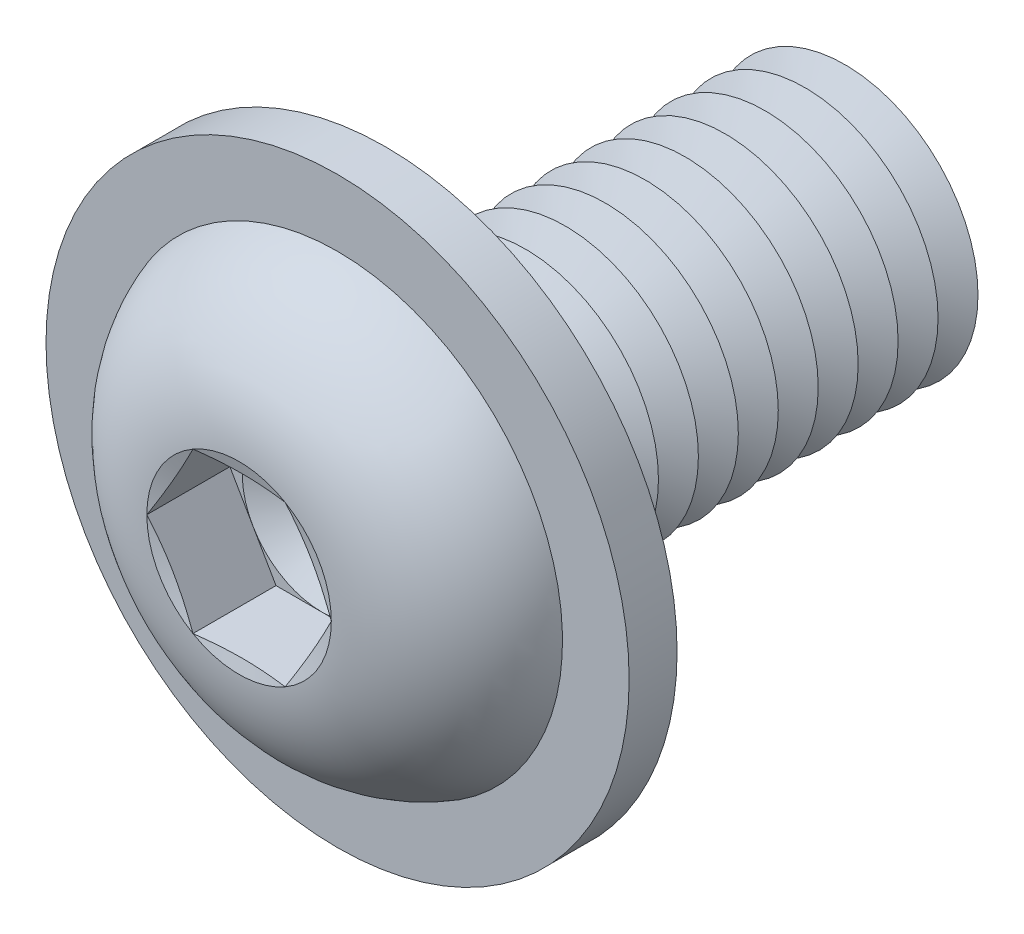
ISO-10303-21;
HEADER;
FILE_DESCRIPTION(('STEP AP214'),'2;1');
FILE_NAME('part.step','',(''),(''),'','','');
FILE_SCHEMA(('AUTOMOTIVE_DESIGN { 1 0 10303 214 1 1 1 1 }'));
ENDSEC;
DATA;
#1=APPLICATION_CONTEXT('core data for automotive mechanical design processes');
#2=APPLICATION_PROTOCOL_DEFINITION('international standard','automotive_design',2000,#1);
#3=PRODUCT_CONTEXT('',#1,'mechanical');
#4=PRODUCT('Part','Part','',(#3));
#5=PRODUCT_RELATED_PRODUCT_CATEGORY('part','',(#4));
#6=PRODUCT_DEFINITION_FORMATION('','',#4);
#7=PRODUCT_DEFINITION_CONTEXT('part definition',#1,'design');
#8=PRODUCT_DEFINITION('design','',#6,#7);
#9=PRODUCT_DEFINITION_SHAPE('','',#8);
#10=(LENGTH_UNIT() NAMED_UNIT(*) SI_UNIT(.MILLI.,.METRE.));
#11=(NAMED_UNIT(*) PLANE_ANGLE_UNIT() SI_UNIT($,.RADIAN.));
#12=(NAMED_UNIT(*) SI_UNIT($,.STERADIAN.) SOLID_ANGLE_UNIT());
#13=UNCERTAINTY_MEASURE_WITH_UNIT(LENGTH_MEASURE(1.E-05),#10,'distance_accuracy_value','');
#14=(GEOMETRIC_REPRESENTATION_CONTEXT(3) GLOBAL_UNCERTAINTY_ASSIGNED_CONTEXT((#13)) GLOBAL_UNIT_ASSIGNED_CONTEXT((#10,
#11,#12)) REPRESENTATION_CONTEXT('',''));
#15=CARTESIAN_POINT('',(0.,0.,0.));
#16=DIRECTION('',(0.,0.,1.));
#17=DIRECTION('',(1.,0.,0.));
#18=AXIS2_PLACEMENT_3D('',#15,#16,#17);
#19=CARTESIAN_POINT('',(0.,0.,-12.75));
#20=DIRECTION('',(0.,0.,1.));
#21=DIRECTION('',(1.,0.,0.));
#22=AXIS2_PLACEMENT_3D('',#19,#20,#21);
#23=CONICAL_SURFACE('',#22,5.,1.0471975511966);
#24=CARTESIAN_POINT('',(0.,0.,-13.5));
#25=DIRECTION('',(0.,0.,1.));
#26=DIRECTION('',(1.,0.,0.));
#27=AXIS2_PLACEMENT_3D('',#24,#25,#26);
#28=CIRCLE('',#27,3.70096189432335);
#29=CARTESIAN_POINT('',(3.70096189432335,0.,-13.5));
#30=VERTEX_POINT('',#29);
#31=EDGE_CURVE('E351',#30,#30,#28,.T.);
#32=ORIENTED_EDGE('',*,*,#31,.T.);
#33=EDGE_LOOP('',(#32));
#34=FACE_BOUND('',#33,.T.);
#35=CARTESIAN_POINT('',(0.,0.,-12.75));
#36=DIRECTION('',(0.,0.,1.));
#37=DIRECTION('',(1.,0.,0.));
#38=AXIS2_PLACEMENT_3D('',#35,#36,#37);
#39=CIRCLE('',#38,5.);
#40=CARTESIAN_POINT('',(5.,0.,-12.75));
#41=VERTEX_POINT('',#40);
#42=EDGE_CURVE('E349',#41,#41,#39,.T.);
#43=ORIENTED_EDGE('',*,*,#42,.F.);
#44=EDGE_LOOP('',(#43));
#45=FACE_BOUND('',#44,.T.);
#46=ADVANCED_FACE('F39',(#34,#45),#23,.T.);
#47=CARTESIAN_POINT('',(0.,0.,-13.5));
#48=DIRECTION('',(0.,0.,-1.));
#49=DIRECTION('',(-1.,0.,0.));
#50=AXIS2_PLACEMENT_3D('',#47,#48,#49);
#51=CONICAL_SURFACE('',#50,3.70096189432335,1.0471975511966);
#52=CARTESIAN_POINT('',(0.,0.,-14.25));
#53=DIRECTION('',(0.,0.,1.));
#54=DIRECTION('',(1.,0.,0.));
#55=AXIS2_PLACEMENT_3D('',#52,#53,#54);
#56=CIRCLE('',#55,5.);
#57=CARTESIAN_POINT('',(5.,0.,-14.25));
#58=VERTEX_POINT('',#57);
#59=EDGE_CURVE('E326',#58,#58,#56,.T.);
#60=ORIENTED_EDGE('',*,*,#59,.T.);
#61=EDGE_LOOP('',(#60));
#62=FACE_BOUND('',#61,.T.);
#63=ORIENTED_EDGE('',*,*,#31,.F.);
#64=EDGE_LOOP('',(#63));
#65=FACE_BOUND('',#64,.T.);
#66=ADVANCED_FACE('F401',(#62,#65),#51,.T.);
#67=CARTESIAN_POINT('',(0.,5.00000000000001,-18.));
#68=DIRECTION('',(0.,0.,-1.));
#69=DIRECTION('',(-1.,0.,0.));
#70=AXIS2_PLACEMENT_3D('',#67,#68,#69);
#71=PLANE('',#70);
#72=CARTESIAN_POINT('',(0.,0.,-18.));
#73=DIRECTION('',(0.,0.,1.));
#74=DIRECTION('',(1.,0.,0.));
#75=AXIS2_PLACEMENT_3D('',#72,#73,#74);
#76=CIRCLE('',#75,3.70096189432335);
#77=CARTESIAN_POINT('',(3.70096189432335,0.,-18.));
#78=VERTEX_POINT('',#77);
#79=EDGE_CURVE('E319',#78,#78,#76,.T.);
#80=ORIENTED_EDGE('',*,*,#79,.F.);
#81=EDGE_LOOP('',(#80));
#82=FACE_BOUND('',#81,.T.);
#83=ADVANCED_FACE('F407',(#82),#71,.T.);
#84=CARTESIAN_POINT('',(0.,0.,-17.25));
#85=DIRECTION('',(0.,0.,1.));
#86=DIRECTION('',(1.,0.,0.));
#87=AXIS2_PLACEMENT_3D('',#84,#85,#86);
#88=CONICAL_SURFACE('',#87,5.,1.0471975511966);
#89=ORIENTED_EDGE('',*,*,#79,.T.);
#90=EDGE_LOOP('',(#89));
#91=FACE_BOUND('',#90,.T.);
#92=CARTESIAN_POINT('',(0.,0.,-17.25));
#93=DIRECTION('',(0.,0.,1.));
#94=DIRECTION('',(1.,0.,0.));
#95=AXIS2_PLACEMENT_3D('',#92,#93,#94);
#96=CIRCLE('',#95,5.);
#97=CARTESIAN_POINT('',(5.,0.,-17.25));
#98=VERTEX_POINT('',#97);
#99=EDGE_CURVE('E441',#98,#98,#96,.T.);
#100=ORIENTED_EDGE('',*,*,#99,.F.);
#101=EDGE_LOOP('',(#100));
#102=FACE_BOUND('',#101,.T.);
#103=ADVANCED_FACE('F427',(#91,#102),#88,.T.);
#104=CARTESIAN_POINT('',(0.,0.,-16.5));
#105=DIRECTION('',(0.,0.,-1.));
#106=DIRECTION('',(-1.,0.,0.));
#107=AXIS2_PLACEMENT_3D('',#104,#105,#106);
#108=CONICAL_SURFACE('',#107,3.70096189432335,1.0471975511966);
#109=ORIENTED_EDGE('',*,*,#99,.T.);
#110=EDGE_LOOP('',(#109));
#111=FACE_BOUND('',#110,.T.);
#112=CARTESIAN_POINT('',(0.,0.,-16.5));
#113=DIRECTION('',(0.,0.,1.));
#114=DIRECTION('',(1.,0.,0.));
#115=AXIS2_PLACEMENT_3D('',#112,#113,#114);
#116=CIRCLE('',#115,3.70096189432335);
#117=CARTESIAN_POINT('',(3.70096189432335,0.,-16.5));
#118=VERTEX_POINT('',#117);
#119=EDGE_CURVE('E445',#118,#118,#116,.T.);
#120=ORIENTED_EDGE('',*,*,#119,.F.);
#121=EDGE_LOOP('',(#120));
#122=FACE_BOUND('',#121,.T.);
#123=ADVANCED_FACE('F424',(#111,#122),#108,.T.);
#124=CARTESIAN_POINT('',(0.,0.,-15.75));
#125=DIRECTION('',(0.,0.,1.));
#126=DIRECTION('',(1.,0.,0.));
#127=AXIS2_PLACEMENT_3D('',#124,#125,#126);
#128=CONICAL_SURFACE('',#127,5.,1.0471975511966);
#129=ORIENTED_EDGE('',*,*,#119,.T.);
#130=EDGE_LOOP('',(#129));
#131=FACE_BOUND('',#130,.T.);
#132=CARTESIAN_POINT('',(0.,0.,-15.75));
#133=DIRECTION('',(0.,0.,1.));
#134=DIRECTION('',(1.,0.,0.));
#135=AXIS2_PLACEMENT_3D('',#132,#133,#134);
#136=CIRCLE('',#135,5.);
#137=CARTESIAN_POINT('',(5.,0.,-15.75));
#138=VERTEX_POINT('',#137);
#139=EDGE_CURVE('E325',#138,#138,#136,.T.);
#140=ORIENTED_EDGE('',*,*,#139,.F.);
#141=EDGE_LOOP('',(#140));
#142=FACE_BOUND('',#141,.T.);
#143=ADVANCED_FACE('F418',(#131,#142),#128,.T.);
#144=CARTESIAN_POINT('',(0.,0.,-15.));
#145=DIRECTION('',(0.,0.,-1.));
#146=DIRECTION('',(-1.,0.,0.));
#147=AXIS2_PLACEMENT_3D('',#144,#145,#146);
#148=CONICAL_SURFACE('',#147,3.70096189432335,1.0471975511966);
#149=ORIENTED_EDGE('',*,*,#139,.T.);
#150=EDGE_LOOP('',(#149));
#151=FACE_BOUND('',#150,.T.);
#152=CARTESIAN_POINT('',(0.,0.,-15.));
#153=DIRECTION('',(0.,0.,1.));
#154=DIRECTION('',(1.,0.,0.));
#155=AXIS2_PLACEMENT_3D('',#152,#153,#154);
#156=CIRCLE('',#155,3.70096189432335);
#157=CARTESIAN_POINT('',(3.70096189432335,0.,-15.));
#158=VERTEX_POINT('',#157);
#159=EDGE_CURVE('E322',#158,#158,#156,.T.);
#160=ORIENTED_EDGE('',*,*,#159,.F.);
#161=EDGE_LOOP('',(#160));
#162=FACE_BOUND('',#161,.T.);
#163=ADVANCED_FACE('F414',(#151,#162),#148,.T.);
#164=CARTESIAN_POINT('',(0.,0.,-14.25));
#165=DIRECTION('',(0.,0.,1.));
#166=DIRECTION('',(1.,0.,0.));
#167=AXIS2_PLACEMENT_3D('',#164,#165,#166);
#168=CONICAL_SURFACE('',#167,5.,1.0471975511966);
#169=ORIENTED_EDGE('',*,*,#159,.T.);
#170=EDGE_LOOP('',(#169));
#171=FACE_BOUND('',#170,.T.);
#172=ORIENTED_EDGE('',*,*,#59,.F.);
#173=EDGE_LOOP('',(#172));
#174=FACE_BOUND('',#173,.T.);
#175=ADVANCED_FACE('F417',(#171,#174),#168,.T.);
#176=CARTESIAN_POINT('',(0.,0.,-11.25));
#177=DIRECTION('',(0.,0.,1.));
#178=DIRECTION('',(1.,0.,0.));
#179=AXIS2_PLACEMENT_3D('',#176,#177,#178);
#180=CONICAL_SURFACE('',#179,5.,1.0471975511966);
#181=CARTESIAN_POINT('',(0.,0.,-12.));
#182=DIRECTION('',(0.,0.,1.));
#183=DIRECTION('',(1.,0.,0.));
#184=AXIS2_PLACEMENT_3D('',#181,#182,#183);
#185=CIRCLE('',#184,3.70096189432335);
#186=CARTESIAN_POINT('',(3.70096189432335,0.,-12.));
#187=VERTEX_POINT('',#186);
#188=EDGE_CURVE('E352',#187,#187,#185,.T.);
#189=ORIENTED_EDGE('',*,*,#188,.T.);
#190=EDGE_LOOP('',(#189));
#191=FACE_BOUND('',#190,.T.);
#192=CARTESIAN_POINT('',(0.,0.,-11.25));
#193=DIRECTION('',(0.,0.,1.));
#194=DIRECTION('',(1.,0.,0.));
#195=AXIS2_PLACEMENT_3D('',#192,#193,#194);
#196=CIRCLE('',#195,5.);
#197=CARTESIAN_POINT('',(5.,0.,-11.25));
#198=VERTEX_POINT('',#197);
#199=EDGE_CURVE('E462',#198,#198,#196,.T.);
#200=ORIENTED_EDGE('',*,*,#199,.F.);
#201=EDGE_LOOP('',(#200));
#202=FACE_BOUND('',#201,.T.);
#203=ADVANCED_FACE('F422',(#191,#202),#180,.T.);
#204=CARTESIAN_POINT('',(0.,0.,-12.));
#205=DIRECTION('',(0.,0.,-1.));
#206=DIRECTION('',(-1.,0.,0.));
#207=AXIS2_PLACEMENT_3D('',#204,#205,#206);
#208=CONICAL_SURFACE('',#207,3.70096189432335,1.0471975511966);
#209=ORIENTED_EDGE('',*,*,#42,.T.);
#210=EDGE_LOOP('',(#209));
#211=FACE_BOUND('',#210,.T.);
#212=ORIENTED_EDGE('',*,*,#188,.F.);
#213=EDGE_LOOP('',(#212));
#214=FACE_BOUND('',#213,.T.);
#215=ADVANCED_FACE('F565',(#211,#214),#208,.T.);
#216=CARTESIAN_POINT('',(0.,0.,-9.75));
#217=DIRECTION('',(0.,0.,1.));
#218=DIRECTION('',(1.,0.,0.));
#219=AXIS2_PLACEMENT_3D('',#216,#217,#218);
#220=CONICAL_SURFACE('',#219,5.,1.0471975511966);
#221=CARTESIAN_POINT('',(0.,0.,-10.5));
#222=DIRECTION('',(0.,0.,1.));
#223=DIRECTION('',(1.,0.,0.));
#224=AXIS2_PLACEMENT_3D('',#221,#222,#223);
#225=CIRCLE('',#224,3.70096189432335);
#226=CARTESIAN_POINT('',(3.70096189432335,0.,-10.5));
#227=VERTEX_POINT('',#226);
#228=EDGE_CURVE('E466',#227,#227,#225,.T.);
#229=ORIENTED_EDGE('',*,*,#228,.T.);
#230=EDGE_LOOP('',(#229));
#231=FACE_BOUND('',#230,.T.);
#232=CARTESIAN_POINT('',(0.,0.,-9.75));
#233=DIRECTION('',(0.,0.,1.));
#234=DIRECTION('',(1.,0.,0.));
#235=AXIS2_PLACEMENT_3D('',#232,#233,#234);
#236=CIRCLE('',#235,5.);
#237=CARTESIAN_POINT('',(5.,0.,-9.75));
#238=VERTEX_POINT('',#237);
#239=EDGE_CURVE('E330',#238,#238,#236,.T.);
#240=ORIENTED_EDGE('',*,*,#239,.F.);
#241=EDGE_LOOP('',(#240));
#242=FACE_BOUND('',#241,.T.);
#243=ADVANCED_FACE('F561',(#231,#242),#220,.T.);
#244=CARTESIAN_POINT('',(0.,0.,-10.5));
#245=DIRECTION('',(0.,0.,-1.));
#246=DIRECTION('',(-1.,0.,0.));
#247=AXIS2_PLACEMENT_3D('',#244,#245,#246);
#248=CONICAL_SURFACE('',#247,3.70096189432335,1.0471975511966);
#249=ORIENTED_EDGE('',*,*,#199,.T.);
#250=EDGE_LOOP('',(#249));
#251=FACE_BOUND('',#250,.T.);
#252=ORIENTED_EDGE('',*,*,#228,.F.);
#253=EDGE_LOOP('',(#252));
#254=FACE_BOUND('',#253,.T.);
#255=ADVANCED_FACE('F557',(#251,#254),#248,.T.);
#256=CARTESIAN_POINT('',(0.,0.,-8.25));
#257=DIRECTION('',(0.,0.,1.));
#258=DIRECTION('',(1.,0.,0.));
#259=AXIS2_PLACEMENT_3D('',#256,#257,#258);
#260=CONICAL_SURFACE('',#259,5.,1.0471975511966);
#261=CARTESIAN_POINT('',(0.,0.,-9.));
#262=DIRECTION('',(0.,0.,1.));
#263=DIRECTION('',(1.,0.,0.));
#264=AXIS2_PLACEMENT_3D('',#261,#262,#263);
#265=CIRCLE('',#264,3.70096189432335);
#266=CARTESIAN_POINT('',(3.70096189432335,0.,-9.));
#267=VERTEX_POINT('',#266);
#268=EDGE_CURVE('E328',#267,#267,#265,.T.);
#269=ORIENTED_EDGE('',*,*,#268,.T.);
#270=EDGE_LOOP('',(#269));
#271=FACE_BOUND('',#270,.T.);
#272=CARTESIAN_POINT('',(0.,0.,-8.25));
#273=DIRECTION('',(0.,0.,1.));
#274=DIRECTION('',(1.,0.,0.));
#275=AXIS2_PLACEMENT_3D('',#272,#273,#274);
#276=CIRCLE('',#275,5.);
#277=CARTESIAN_POINT('',(5.,0.,-8.25));
#278=VERTEX_POINT('',#277);
#279=EDGE_CURVE('E331',#278,#278,#276,.T.);
#280=ORIENTED_EDGE('',*,*,#279,.F.);
#281=EDGE_LOOP('',(#280));
#282=FACE_BOUND('',#281,.T.);
#283=ADVANCED_FACE('F553',(#271,#282),#260,.T.);
#284=CARTESIAN_POINT('',(0.,0.,-9.));
#285=DIRECTION('',(0.,0.,-1.));
#286=DIRECTION('',(-1.,0.,0.));
#287=AXIS2_PLACEMENT_3D('',#284,#285,#286);
#288=CONICAL_SURFACE('',#287,3.70096189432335,1.0471975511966);
#289=ORIENTED_EDGE('',*,*,#239,.T.);
#290=EDGE_LOOP('',(#289));
#291=FACE_BOUND('',#290,.T.);
#292=ORIENTED_EDGE('',*,*,#268,.F.);
#293=EDGE_LOOP('',(#292));
#294=FACE_BOUND('',#293,.T.);
#295=ADVANCED_FACE('F549',(#291,#294),#288,.T.);
#296=CARTESIAN_POINT('',(0.,0.,-6.75));
#297=DIRECTION('',(0.,0.,1.));
#298=DIRECTION('',(1.,0.,0.));
#299=AXIS2_PLACEMENT_3D('',#296,#297,#298);
#300=CONICAL_SURFACE('',#299,5.,1.0471975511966);
#301=CARTESIAN_POINT('',(0.,0.,-7.5));
#302=DIRECTION('',(0.,0.,1.));
#303=DIRECTION('',(1.,0.,0.));
#304=AXIS2_PLACEMENT_3D('',#301,#302,#303);
#305=CIRCLE('',#304,3.70096189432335);
#306=CARTESIAN_POINT('',(3.70096189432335,0.,-7.5));
#307=VERTEX_POINT('',#306);
#308=EDGE_CURVE('E337',#307,#307,#305,.T.);
#309=ORIENTED_EDGE('',*,*,#308,.T.);
#310=EDGE_LOOP('',(#309));
#311=FACE_BOUND('',#310,.T.);
#312=CARTESIAN_POINT('',(0.,0.,-6.75));
#313=DIRECTION('',(0.,0.,1.));
#314=DIRECTION('',(1.,0.,0.));
#315=AXIS2_PLACEMENT_3D('',#312,#313,#314);
#316=CIRCLE('',#315,5.);
#317=CARTESIAN_POINT('',(5.,0.,-6.75));
#318=VERTEX_POINT('',#317);
#319=EDGE_CURVE('E334',#318,#318,#316,.T.);
#320=ORIENTED_EDGE('',*,*,#319,.F.);
#321=EDGE_LOOP('',(#320));
#322=FACE_BOUND('',#321,.T.);
#323=ADVANCED_FACE('F545',(#311,#322),#300,.T.);
#324=CARTESIAN_POINT('',(0.,0.,-7.5));
#325=DIRECTION('',(0.,0.,-1.));
#326=DIRECTION('',(-1.,0.,0.));
#327=AXIS2_PLACEMENT_3D('',#324,#325,#326);
#328=CONICAL_SURFACE('',#327,3.70096189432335,1.0471975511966);
#329=ORIENTED_EDGE('',*,*,#279,.T.);
#330=EDGE_LOOP('',(#329));
#331=FACE_BOUND('',#330,.T.);
#332=ORIENTED_EDGE('',*,*,#308,.F.);
#333=EDGE_LOOP('',(#332));
#334=FACE_BOUND('',#333,.T.);
#335=ADVANCED_FACE('F541',(#331,#334),#328,.T.);
#336=CARTESIAN_POINT('',(0.,0.,-5.25));
#337=DIRECTION('',(0.,0.,1.));
#338=DIRECTION('',(1.,0.,0.));
#339=AXIS2_PLACEMENT_3D('',#336,#337,#338);
#340=CONICAL_SURFACE('',#339,5.,1.0471975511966);
#341=CARTESIAN_POINT('',(0.,0.,-6.));
#342=DIRECTION('',(0.,0.,1.));
#343=DIRECTION('',(1.,0.,0.));
#344=AXIS2_PLACEMENT_3D('',#341,#342,#343);
#345=CIRCLE('',#344,3.70096189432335);
#346=CARTESIAN_POINT('',(3.70096189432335,0.,-6.));
#347=VERTEX_POINT('',#346);
#348=EDGE_CURVE('E338',#347,#347,#345,.T.);
#349=ORIENTED_EDGE('',*,*,#348,.T.);
#350=EDGE_LOOP('',(#349));
#351=FACE_BOUND('',#350,.T.);
#352=CARTESIAN_POINT('',(0.,0.,-5.25));
#353=DIRECTION('',(0.,0.,1.));
#354=DIRECTION('',(1.,0.,0.));
#355=AXIS2_PLACEMENT_3D('',#352,#353,#354);
#356=CIRCLE('',#355,5.);
#357=CARTESIAN_POINT('',(5.,0.,-5.25));
#358=VERTEX_POINT('',#357);
#359=EDGE_CURVE('E479',#358,#358,#356,.T.);
#360=ORIENTED_EDGE('',*,*,#359,.F.);
#361=EDGE_LOOP('',(#360));
#362=FACE_BOUND('',#361,.T.);
#363=ADVANCED_FACE('F537',(#351,#362),#340,.T.);
#364=CARTESIAN_POINT('',(0.,0.,-6.));
#365=DIRECTION('',(0.,0.,-1.));
#366=DIRECTION('',(-1.,0.,0.));
#367=AXIS2_PLACEMENT_3D('',#364,#365,#366);
#368=CONICAL_SURFACE('',#367,3.70096189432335,1.0471975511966);
#369=ORIENTED_EDGE('',*,*,#319,.T.);
#370=EDGE_LOOP('',(#369));
#371=FACE_BOUND('',#370,.T.);
#372=ORIENTED_EDGE('',*,*,#348,.F.);
#373=EDGE_LOOP('',(#372));
#374=FACE_BOUND('',#373,.T.);
#375=ADVANCED_FACE('F533',(#371,#374),#368,.T.);
#376=CARTESIAN_POINT('',(0.,0.,-3.75));
#377=DIRECTION('',(0.,0.,1.));
#378=DIRECTION('',(1.,0.,0.));
#379=AXIS2_PLACEMENT_3D('',#376,#377,#378);
#380=CONICAL_SURFACE('',#379,5.,1.0471975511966);
#381=CARTESIAN_POINT('',(0.,0.,-4.5));
#382=DIRECTION('',(0.,0.,1.));
#383=DIRECTION('',(1.,0.,0.));
#384=AXIS2_PLACEMENT_3D('',#381,#382,#383);
#385=CIRCLE('',#384,3.70096189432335);
#386=CARTESIAN_POINT('',(3.70096189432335,0.,-4.5));
#387=VERTEX_POINT('',#386);
#388=EDGE_CURVE('E483',#387,#387,#385,.T.);
#389=ORIENTED_EDGE('',*,*,#388,.T.);
#390=EDGE_LOOP('',(#389));
#391=FACE_BOUND('',#390,.T.);
#392=CARTESIAN_POINT('',(0.,0.,-3.75));
#393=DIRECTION('',(0.,0.,1.));
#394=DIRECTION('',(1.,0.,0.));
#395=AXIS2_PLACEMENT_3D('',#392,#393,#394);
#396=CIRCLE('',#395,5.);
#397=CARTESIAN_POINT('',(5.,0.,-3.75));
#398=VERTEX_POINT('',#397);
#399=EDGE_CURVE('E487',#398,#398,#396,.T.);
#400=ORIENTED_EDGE('',*,*,#399,.F.);
#401=EDGE_LOOP('',(#400));
#402=FACE_BOUND('',#401,.T.);
#403=ADVANCED_FACE('F529',(#391,#402),#380,.T.);
#404=CARTESIAN_POINT('',(0.,0.,-4.5));
#405=DIRECTION('',(0.,0.,-1.));
#406=DIRECTION('',(-1.,0.,0.));
#407=AXIS2_PLACEMENT_3D('',#404,#405,#406);
#408=CONICAL_SURFACE('',#407,3.70096189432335,1.0471975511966);
#409=ORIENTED_EDGE('',*,*,#359,.T.);
#410=EDGE_LOOP('',(#409));
#411=FACE_BOUND('',#410,.T.);
#412=ORIENTED_EDGE('',*,*,#388,.F.);
#413=EDGE_LOOP('',(#412));
#414=FACE_BOUND('',#413,.T.);
#415=ADVANCED_FACE('F525',(#411,#414),#408,.T.);
#416=CARTESIAN_POINT('',(0.,0.,-2.25));
#417=DIRECTION('',(0.,0.,1.));
#418=DIRECTION('',(1.,0.,0.));
#419=AXIS2_PLACEMENT_3D('',#416,#417,#418);
#420=CONICAL_SURFACE('',#419,5.,1.0471975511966);
#421=CARTESIAN_POINT('',(0.,0.,-3.));
#422=DIRECTION('',(0.,0.,1.));
#423=DIRECTION('',(1.,0.,0.));
#424=AXIS2_PLACEMENT_3D('',#421,#422,#423);
#425=CIRCLE('',#424,3.70096189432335);
#426=CARTESIAN_POINT('',(3.70096189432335,0.,-3.));
#427=VERTEX_POINT('',#426);
#428=EDGE_CURVE('E490',#427,#427,#425,.T.);
#429=ORIENTED_EDGE('',*,*,#428,.T.);
#430=EDGE_LOOP('',(#429));
#431=FACE_BOUND('',#430,.T.);
#432=CARTESIAN_POINT('',(0.,0.,-2.25));
#433=DIRECTION('',(0.,0.,1.));
#434=DIRECTION('',(1.,0.,0.));
#435=AXIS2_PLACEMENT_3D('',#432,#433,#434);
#436=CIRCLE('',#435,5.);
#437=CARTESIAN_POINT('',(5.,0.,-2.25));
#438=VERTEX_POINT('',#437);
#439=EDGE_CURVE('E497',#438,#438,#436,.T.);
#440=ORIENTED_EDGE('',*,*,#439,.F.);
#441=EDGE_LOOP('',(#440));
#442=FACE_BOUND('',#441,.T.);
#443=ADVANCED_FACE('F519',(#431,#442),#420,.T.);
#444=CARTESIAN_POINT('',(0.,0.,-3.));
#445=DIRECTION('',(0.,0.,-1.));
#446=DIRECTION('',(-1.,0.,0.));
#447=AXIS2_PLACEMENT_3D('',#444,#445,#446);
#448=CONICAL_SURFACE('',#447,3.70096189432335,1.0471975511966);
#449=ORIENTED_EDGE('',*,*,#399,.T.);
#450=EDGE_LOOP('',(#449));
#451=FACE_BOUND('',#450,.T.);
#452=ORIENTED_EDGE('',*,*,#428,.F.);
#453=EDGE_LOOP('',(#452));
#454=FACE_BOUND('',#453,.T.);
#455=ADVANCED_FACE('F515',(#451,#454),#448,.T.);
#456=CARTESIAN_POINT('',(0.,0.,-0.750000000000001));
#457=DIRECTION('',(0.,0.,1.));
#458=DIRECTION('',(1.,0.,0.));
#459=AXIS2_PLACEMENT_3D('',#456,#457,#458);
#460=CONICAL_SURFACE('',#459,5.,1.0471975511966);
#461=CARTESIAN_POINT('',(0.,0.,-1.5));
#462=DIRECTION('',(0.,0.,1.));
#463=DIRECTION('',(1.,0.,0.));
#464=AXIS2_PLACEMENT_3D('',#461,#462,#463);
#465=CIRCLE('',#464,3.70096189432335);
#466=CARTESIAN_POINT('',(3.70096189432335,0.,-1.5));
#467=VERTEX_POINT('',#466);
#468=EDGE_CURVE('E227',#467,#467,#465,.T.);
#469=ORIENTED_EDGE('',*,*,#468,.T.);
#470=EDGE_LOOP('',(#469));
#471=FACE_BOUND('',#470,.T.);
#472=CARTESIAN_POINT('',(0.,0.,-0.750000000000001));
#473=DIRECTION('',(0.,0.,1.));
#474=DIRECTION('',(1.,0.,0.));
#475=AXIS2_PLACEMENT_3D('',#472,#473,#474);
#476=CIRCLE('',#475,5.);
#477=CARTESIAN_POINT('',(5.,0.,-0.750000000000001));
#478=VERTEX_POINT('',#477);
#479=EDGE_CURVE('E494',#478,#478,#476,.T.);
#480=ORIENTED_EDGE('',*,*,#479,.F.);
#481=EDGE_LOOP('',(#480));
#482=FACE_BOUND('',#481,.T.);
#483=ADVANCED_FACE('F506',(#471,#482),#460,.T.);
#484=CARTESIAN_POINT('',(0.,0.,-1.5));
#485=DIRECTION('',(0.,0.,-1.));
#486=DIRECTION('',(-1.,0.,0.));
#487=AXIS2_PLACEMENT_3D('',#484,#485,#486);
#488=CONICAL_SURFACE('',#487,3.70096189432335,1.0471975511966);
#489=ORIENTED_EDGE('',*,*,#439,.T.);
#490=EDGE_LOOP('',(#489));
#491=FACE_BOUND('',#490,.T.);
#492=ORIENTED_EDGE('',*,*,#468,.F.);
#493=EDGE_LOOP('',(#492));
#494=FACE_BOUND('',#493,.T.);
#495=ADVANCED_FACE('F211',(#491,#494),#488,.T.);
#496=CARTESIAN_POINT('',(0.,5.,0.));
#497=DIRECTION('',(0.,0.,-1.));
#498=DIRECTION('',(-1.,0.,0.));
#499=AXIS2_PLACEMENT_3D('',#496,#497,#498);
#500=PLANE('',#499);
#501=CARTESIAN_POINT('',(0.,0.,0.));
#502=DIRECTION('',(0.,0.,-1.));
#503=DIRECTION('',(-1.,0.,0.));
#504=AXIS2_PLACEMENT_3D('',#501,#502,#503);
#505=CIRCLE('',#504,5.75);
#506=CARTESIAN_POINT('',(-5.75,0.,0.));
#507=VERTEX_POINT('',#506);
#508=EDGE_CURVE('E282',#507,#507,#505,.F.);
#509=ORIENTED_EDGE('',*,*,#508,.T.);
#510=EDGE_LOOP('',(#509));
#511=FACE_BOUND('',#510,.T.);
#512=CARTESIAN_POINT('',(0.,0.,0.));
#513=DIRECTION('',(0.,0.,-1.));
#514=DIRECTION('',(0.,1.,0.));
#515=AXIS2_PLACEMENT_3D('',#512,#513,#514);
#516=CIRCLE('',#515,10.95);
#517=CARTESIAN_POINT('',(0.,10.95,0.));
#518=VERTEX_POINT('',#517);
#519=EDGE_CURVE('E959',#518,#518,#516,.T.);
#520=ORIENTED_EDGE('',*,*,#519,.T.);
#521=EDGE_LOOP('',(#520));
#522=FACE_BOUND('',#521,.T.);
#523=ADVANCED_FACE('F510',(#511,#522),#500,.T.);
#524=CARTESIAN_POINT('',(0.,0.,-0.750000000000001));
#525=DIRECTION('',(0.,0.,-1.));
#526=DIRECTION('',(-1.,0.,0.));
#527=AXIS2_PLACEMENT_3D('',#524,#525,#526);
#528=TOROIDAL_SURFACE('',#527,5.75,0.75);
#529=ORIENTED_EDGE('',*,*,#508,.F.);
#530=EDGE_LOOP('',(#529));
#531=FACE_BOUND('',#530,.T.);
#532=ORIENTED_EDGE('',*,*,#479,.T.);
#533=EDGE_LOOP('',(#532));
#534=FACE_BOUND('',#533,.T.);
#535=ADVANCED_FACE('F41',(#531,#534),#528,.F.);
#536=CARTESIAN_POINT('',(0.,0.,1.8));
#537=DIRECTION('',(0.,0.,-1.));
#538=DIRECTION('',(0.,1.,0.));
#539=AXIS2_PLACEMENT_3D('',#536,#537,#538);
#540=CYLINDRICAL_SURFACE('',#539,10.95);
#541=CARTESIAN_POINT('',(0.,0.,1.8));
#542=DIRECTION('',(0.,0.,-1.));
#543=DIRECTION('',(0.,1.,0.));
#544=AXIS2_PLACEMENT_3D('',#541,#542,#543);
#545=CIRCLE('',#544,10.95);
#546=CARTESIAN_POINT('',(0.,10.95,1.8));
#547=VERTEX_POINT('',#546);
#548=EDGE_CURVE('E347',#547,#547,#545,.T.);
#549=ORIENTED_EDGE('',*,*,#548,.T.);
#550=EDGE_LOOP('',(#549));
#551=FACE_BOUND('',#550,.T.);
#552=ORIENTED_EDGE('',*,*,#519,.F.);
#553=EDGE_LOOP('',(#552));
#554=FACE_BOUND('',#553,.T.);
#555=ADVANCED_FACE('F662',(#551,#554),#540,.T.);
#556=CARTESIAN_POINT('',(0.,0.,1.8));
#557=DIRECTION('',(0.,0.,-1.));
#558=DIRECTION('',(0.,1.,0.));
#559=AXIS2_PLACEMENT_3D('',#556,#557,#558);
#560=PLANE('',#559);
#561=CARTESIAN_POINT('',(0.,0.,1.8));
#562=DIRECTION('',(0.,0.,-1.));
#563=DIRECTION('',(0.,1.,0.));
#564=AXIS2_PLACEMENT_3D('',#561,#562,#563);
#565=CIRCLE('',#564,8.44736706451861);
#566=CARTESIAN_POINT('',(0.,8.44736706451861,1.8));
#567=VERTEX_POINT('',#566);
#568=EDGE_CURVE('E43',#567,#567,#565,.F.);
#569=ORIENTED_EDGE('',*,*,#568,.F.);
#570=EDGE_LOOP('',(#569));
#571=FACE_BOUND('',#570,.T.);
#572=ORIENTED_EDGE('',*,*,#548,.F.);
#573=EDGE_LOOP('',(#572));
#574=FACE_BOUND('',#573,.T.);
#575=ADVANCED_FACE('F117',(#571,#574),#560,.F.);
#576=CARTESIAN_POINT('',(0.,0.,2.38));
#577=DIRECTION('',(0.,0.,1.));
#578=DIRECTION('',(1.,0.,0.));
#579=AXIS2_PLACEMENT_3D('',#576,#577,#578);
#580=CONICAL_SURFACE('',#579,2.99999860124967,1.0471975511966);
#581=CARTESIAN_POINT('',(0.,0.,0.64795000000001));
#582=VERTEX_POINT('',#581);
#583=VERTEX_LOOP('',#582);
#584=FACE_BOUND('',#583,.T.);
#585=CARTESIAN_POINT('',(0.,0.,2.38));
#586=DIRECTION('',(0.,0.,1.));
#587=DIRECTION('',(1.,0.,0.));
#588=AXIS2_PLACEMENT_3D('',#585,#586,#587);
#589=CIRCLE('',#588,2.99999860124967);
#590=CARTESIAN_POINT('',(2.598075,1.49999930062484,2.38));
#591=VERTEX_POINT('',#590);
#592=CARTESIAN_POINT('',(0.,2.99999860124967,2.38));
#593=VERTEX_POINT('',#592);
#594=EDGE_CURVE('E120',#591,#593,#589,.T.);
#595=ORIENTED_EDGE('',*,*,#594,.T.);
#596=CARTESIAN_POINT('',(0.,0.,2.38));
#597=DIRECTION('',(0.,0.,1.));
#598=DIRECTION('',(1.,0.,0.));
#599=AXIS2_PLACEMENT_3D('',#596,#597,#598);
#600=CIRCLE('',#599,2.99999860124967);
#601=CARTESIAN_POINT('',(-2.598075,1.49999930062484,2.38));
#602=VERTEX_POINT('',#601);
#603=EDGE_CURVE('E11',#593,#602,#600,.T.);
#604=ORIENTED_EDGE('',*,*,#603,.T.);
#605=CARTESIAN_POINT('',(-2.598075,-1.49999930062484,2.38));
#606=VERTEX_POINT('',#605);
#607=EDGE_CURVE('E49',#602,#606,#600,.T.);
#608=ORIENTED_EDGE('',*,*,#607,.T.);
#609=CARTESIAN_POINT('',(0.,-2.99999860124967,2.38));
#610=VERTEX_POINT('',#609);
#611=EDGE_CURVE('E285',#606,#610,#600,.T.);
#612=ORIENTED_EDGE('',*,*,#611,.T.);
#613=CARTESIAN_POINT('',(2.598075,-1.49999930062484,2.38));
#614=VERTEX_POINT('',#613);
#615=EDGE_CURVE('E57',#610,#614,#600,.T.);
#616=ORIENTED_EDGE('',*,*,#615,.T.);
#617=EDGE_CURVE('E50',#614,#591,#600,.T.);
#618=ORIENTED_EDGE('',*,*,#617,.T.);
#619=EDGE_LOOP('',(#595,#604,#608,#612,#616,#618));
#620=FACE_BOUND('',#619,.T.);
#621=ADVANCED_FACE('F114',(#584,#620),#580,.F.);
#622=CARTESIAN_POINT('',(0.,0.,2.38));
#623=DIRECTION('',(0.,0.,1.));
#624=DIRECTION('',(1.,0.,0.));
#625=AXIS2_PLACEMENT_3D('',#622,#623,#624);
#626=PLANE('',#625);
#627=ORIENTED_EDGE('',*,*,#611,.F.);
#628=DIRECTION('',(0.5,-0.866025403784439,0.));
#629=VECTOR('',#628,1.);
#630=CARTESIAN_POINT('',(-3.4641,0.,2.38));
#631=LINE('',#630,#629);
#632=CARTESIAN_POINT('',(-1.73205,-2.99999860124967,2.38));
#633=VERTEX_POINT('',#632);
#634=EDGE_CURVE('E153',#606,#633,#631,.T.);
#635=ORIENTED_EDGE('',*,*,#634,.T.);
#636=DIRECTION('',(1.,0.,0.));
#637=VECTOR('',#636,1.);
#638=CARTESIAN_POINT('',(-1.73205,-2.99999860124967,2.38));
#639=LINE('',#638,#637);
#640=EDGE_CURVE('E159',#633,#610,#639,.T.);
#641=ORIENTED_EDGE('',*,*,#640,.T.);
#642=EDGE_LOOP('',(#627,#635,#641));
#643=FACE_BOUND('',#642,.T.);
#644=ADVANCED_FACE('F116',(#643),#626,.T.);
#645=ORIENTED_EDGE('',*,*,#615,.F.);
#646=CARTESIAN_POINT('',(1.73205,-2.99999860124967,2.38));
#647=VERTEX_POINT('',#646);
#648=EDGE_CURVE('E158',#610,#647,#639,.T.);
#649=ORIENTED_EDGE('',*,*,#648,.T.);
#650=DIRECTION('',(0.5,0.866025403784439,0.));
#651=VECTOR('',#650,1.);
#652=CARTESIAN_POINT('',(1.73205,-2.99999860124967,2.38));
#653=LINE('',#652,#651);
#654=EDGE_CURVE('E164',#647,#614,#653,.T.);
#655=ORIENTED_EDGE('',*,*,#654,.T.);
#656=EDGE_LOOP('',(#645,#649,#655));
#657=FACE_BOUND('',#656,.T.);
#658=ADVANCED_FACE('F692',(#657),#626,.T.);
#659=ORIENTED_EDGE('',*,*,#617,.F.);
#660=CARTESIAN_POINT('',(3.4641,0.,2.38));
#661=VERTEX_POINT('',#660);
#662=EDGE_CURVE('E163',#614,#661,#653,.T.);
#663=ORIENTED_EDGE('',*,*,#662,.T.);
#664=DIRECTION('',(-0.5,0.866025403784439,0.));
#665=VECTOR('',#664,1.);
#666=CARTESIAN_POINT('',(3.4641,0.,2.38));
#667=LINE('',#666,#665);
#668=EDGE_CURVE('E142',#661,#591,#667,.T.);
#669=ORIENTED_EDGE('',*,*,#668,.T.);
#670=EDGE_LOOP('',(#659,#663,#669));
#671=FACE_BOUND('',#670,.T.);
#672=ADVANCED_FACE('F701',(#671),#626,.T.);
#673=ORIENTED_EDGE('',*,*,#594,.F.);
#674=CARTESIAN_POINT('',(1.73205,2.99999860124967,2.38));
#675=VERTEX_POINT('',#674);
#676=EDGE_CURVE('E127',#591,#675,#667,.T.);
#677=ORIENTED_EDGE('',*,*,#676,.T.);
#678=DIRECTION('',(-1.,0.,0.));
#679=VECTOR('',#678,1.);
#680=CARTESIAN_POINT('',(1.73205,2.99999860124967,2.38));
#681=LINE('',#680,#679);
#682=EDGE_CURVE('E138',#675,#593,#681,.T.);
#683=ORIENTED_EDGE('',*,*,#682,.T.);
#684=EDGE_LOOP('',(#673,#677,#683));
#685=FACE_BOUND('',#684,.T.);
#686=ADVANCED_FACE('F144',(#685),#626,.T.);
#687=ORIENTED_EDGE('',*,*,#603,.F.);
#688=CARTESIAN_POINT('',(-1.73205,2.99999860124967,2.38));
#689=VERTEX_POINT('',#688);
#690=EDGE_CURVE('E133',#593,#689,#681,.T.);
#691=ORIENTED_EDGE('',*,*,#690,.T.);
#692=DIRECTION('',(-0.5,-0.866025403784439,0.));
#693=VECTOR('',#692,1.);
#694=CARTESIAN_POINT('',(-1.73205,2.99999860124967,2.38));
#695=LINE('',#694,#693);
#696=EDGE_CURVE('E136',#689,#602,#695,.T.);
#697=ORIENTED_EDGE('',*,*,#696,.T.);
#698=EDGE_LOOP('',(#687,#691,#697));
#699=FACE_BOUND('',#698,.T.);
#700=ADVANCED_FACE('F132',(#699),#626,.T.);
#701=ORIENTED_EDGE('',*,*,#607,.F.);
#702=CARTESIAN_POINT('',(-3.4641,0.,2.38));
#703=VERTEX_POINT('',#702);
#704=EDGE_CURVE('E146',#602,#703,#695,.T.);
#705=ORIENTED_EDGE('',*,*,#704,.T.);
#706=EDGE_CURVE('E154',#703,#606,#631,.T.);
#707=ORIENTED_EDGE('',*,*,#706,.T.);
#708=EDGE_LOOP('',(#701,#705,#707));
#709=FACE_BOUND('',#708,.T.);
#710=ADVANCED_FACE('F262',(#709),#626,.T.);
#711=CARTESIAN_POINT('',(-3.4641,0.,2.38));
#712=DIRECTION('',(-0.866025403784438,-0.5,0.));
#713=DIRECTION('',(0.5,-0.866025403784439,0.));
#714=AXIS2_PLACEMENT_3D('',#711,#712,#713);
#715=PLANE('',#714);
#716=CARTESIAN_POINT('',(-3.46421547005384,0.000200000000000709,5.50003094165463));
#717=CARTESIAN_POINT('',(-3.39227822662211,-0.12439896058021,5.48074619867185));
#718=CARTESIAN_POINT('',(-3.32021054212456,-0.249223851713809,5.46323875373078));
#719=CARTESIAN_POINT('',(-3.17582062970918,-0.499314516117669,5.43247971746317));
#720=CARTESIAN_POINT('',(-3.10349831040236,-0.624580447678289,5.41922985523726));
#721=CARTESIAN_POINT('',(-2.95903767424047,-0.874793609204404,5.39775958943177));
#722=CARTESIAN_POINT('',(-2.88690033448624,-0.999739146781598,5.38951357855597));
#723=CARTESIAN_POINT('',(-2.74253364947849,-1.24978958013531,5.37845651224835));
#724=CARTESIAN_POINT('',(-2.67030432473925,-1.37489444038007,5.3756444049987));
#725=CARTESIAN_POINT('',(-2.52584567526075,-1.6251041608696,5.3756444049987));
#726=CARTESIAN_POINT('',(-2.45361635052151,-1.75020902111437,5.37845651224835));
#727=CARTESIAN_POINT('',(-2.30924966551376,-2.00025945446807,5.38951357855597));
#728=CARTESIAN_POINT('',(-2.23711232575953,-2.12520499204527,5.39775958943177));
#729=CARTESIAN_POINT('',(-2.09265168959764,-2.37541815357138,5.41922985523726));
#730=CARTESIAN_POINT('',(-2.02032937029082,-2.500684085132,5.43247971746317));
#731=CARTESIAN_POINT('',(-1.87593945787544,-2.75077474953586,5.46323875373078));
#732=CARTESIAN_POINT('',(-1.80387177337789,-2.87559964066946,5.48074619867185));
#733=CARTESIAN_POINT('',(-1.73193452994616,-3.00019860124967,5.50003094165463));
#734=B_SPLINE_CURVE_WITH_KNOTS('',3,(#716,#717,#718,#719,#720,#721,#722,#723,#724,#725,#726,
#727,#728,#729,#730,#731,#732,#733),.UNSPECIFIED.,.F.,.F.,(4,2,2,2,2,2,2,2,4),(0.,
0.435506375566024,0.871189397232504,1.3046235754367,1.7379738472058,2.1713241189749,
2.6047582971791,3.04044131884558,3.4759476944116),.UNSPECIFIED.);
#735=CARTESIAN_POINT('',(-3.4641,0.,5.5));
#736=VERTEX_POINT('',#735);
#737=CARTESIAN_POINT('',(-1.73205,-2.99999860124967,5.5));
#738=VERTEX_POINT('',#737);
#739=EDGE_CURVE('E238',#736,#738,#734,.T.);
#740=ORIENTED_EDGE('',*,*,#739,.T.);
#741=DIRECTION('',(0.,0.,1.));
#742=VECTOR('',#741,1.);
#743=CARTESIAN_POINT('',(-1.73205,-2.99999860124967,2.38));
#744=LINE('',#743,#742);
#745=EDGE_CURVE('E178',#633,#738,#744,.T.);
#746=ORIENTED_EDGE('',*,*,#745,.F.);
#747=ORIENTED_EDGE('',*,*,#634,.F.);
#748=ORIENTED_EDGE('',*,*,#706,.F.);
#749=DIRECTION('',(0.,0.,1.));
#750=VECTOR('',#749,1.);
#751=CARTESIAN_POINT('',(-3.4641,0.,2.38));
#752=LINE('',#751,#750);
#753=EDGE_CURVE('E174',#703,#736,#752,.T.);
#754=ORIENTED_EDGE('',*,*,#753,.T.);
#755=EDGE_LOOP('',(#740,#746,#747,#748,#754));
#756=FACE_BOUND('',#755,.T.);
#757=ADVANCED_FACE('F256',(#756),#715,.F.);
#758=CARTESIAN_POINT('',(-1.73205,-2.99999860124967,2.38));
#759=DIRECTION('',(0.,-1.,0.));
#760=DIRECTION('',(0.,0.,-1.));
#761=AXIS2_PLACEMENT_3D('',#758,#759,#760);
#762=PLANE('',#761);
#763=CARTESIAN_POINT('',(-5.2273006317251,-2.99999860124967,6.18672552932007));
#764=CARTESIAN_POINT('',(-5.10075887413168,-2.99999860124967,6.15732018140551));
#765=CARTESIAN_POINT('',(-4.97415993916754,-2.99999860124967,6.12816064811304));
#766=CARTESIAN_POINT('',(-4.72082394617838,-2.99999860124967,6.07043857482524));
#767=CARTESIAN_POINT('',(-4.59408688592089,-2.99999860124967,6.04187604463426));
#768=CARTESIAN_POINT('',(-4.21358997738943,-2.99999860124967,5.95723252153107));
#769=CARTESIAN_POINT('',(-3.95959339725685,-2.99999860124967,5.90220706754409));
#770=CARTESIAN_POINT('',(-3.44835573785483,-2.99999860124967,5.79574115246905));
#771=CARTESIAN_POINT('',(-3.19110656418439,-2.99999860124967,5.74433913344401));
#772=CARTESIAN_POINT('',(-2.67540790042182,-2.99999860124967,5.6477299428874));
#773=CARTESIAN_POINT('',(-2.41695830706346,-2.99999860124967,5.60252331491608));
#774=CARTESIAN_POINT('',(-1.9055512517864,-2.99999860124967,5.52251897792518));
#775=CARTESIAN_POINT('',(-1.65263426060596,-2.99999860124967,5.48747285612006));
#776=CARTESIAN_POINT('',(-1.27220564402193,-2.99999860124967,5.44439602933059));
#777=CARTESIAN_POINT('',(-1.1452320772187,-2.99999860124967,5.43161987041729));
#778=CARTESIAN_POINT('',(-0.890973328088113,-2.99999860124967,5.40972605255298));
#779=CARTESIAN_POINT('',(-0.76368816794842,-2.99999860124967,5.40060814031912));
#780=CARTESIAN_POINT('',(-0.509442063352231,-2.99999860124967,5.38647457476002));
#781=CARTESIAN_POINT('',(-0.382482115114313,-2.99999860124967,5.38144125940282));
#782=CARTESIAN_POINT('',(-0.128463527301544,-2.99999860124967,5.37566637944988));
#783=CARTESIAN_POINT('',(-0.00140488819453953,-2.99999860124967,5.37492479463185));
#784=CARTESIAN_POINT('',(0.252672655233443,-2.99999860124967,5.37777315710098));
#785=CARTESIAN_POINT('',(0.379691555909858,-2.99999860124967,5.38136342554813));
#786=CARTESIAN_POINT('',(0.63354019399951,-2.99999860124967,5.39268816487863));
#787=CARTESIAN_POINT('',(0.760369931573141,-2.99999860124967,5.40042263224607));
#788=CARTESIAN_POINT('',(1.06836981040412,-2.99999860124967,5.42382465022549));
#789=CARTESIAN_POINT('',(1.24938929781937,-2.99999860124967,5.44147485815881));
#790=CARTESIAN_POINT('',(1.61066786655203,-2.99999860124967,5.48312309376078));
#791=CARTESIAN_POINT('',(1.7909269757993,-2.99999860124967,5.50712088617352));
#792=CARTESIAN_POINT('',(2.15127612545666,-2.99999860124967,5.56013471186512));
#793=CARTESIAN_POINT('',(2.33136383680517,-2.99999860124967,5.58916634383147));
#794=CARTESIAN_POINT('',(2.690892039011,-2.99999860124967,5.65100028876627));
#795=CARTESIAN_POINT('',(2.87033249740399,-2.99999860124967,5.68380278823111));
#796=CARTESIAN_POINT('',(3.23235399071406,-2.99999860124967,5.75295369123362));
#797=CARTESIAN_POINT('',(3.4149236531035,-2.99999860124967,5.78936117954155));
#798=CARTESIAN_POINT('',(3.77960351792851,-2.99999860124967,5.864406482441));
#799=CARTESIAN_POINT('',(3.96171371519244,-2.99999860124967,5.903044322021));
#800=CARTESIAN_POINT('',(4.32457472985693,-2.99999860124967,5.9817966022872));
#801=CARTESIAN_POINT('',(4.5053275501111,-2.99999860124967,6.02190185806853));
#802=CARTESIAN_POINT('',(4.86652484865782,-2.99999860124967,6.10342152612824));
#803=CARTESIAN_POINT('',(5.04696934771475,-2.99999860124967,6.14483584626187));
#804=CARTESIAN_POINT('',(5.2273006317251,-2.99999860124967,6.18672552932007));
#805=B_SPLINE_CURVE_WITH_KNOTS('',3,(#763,#764,#765,#766,#767,#768,#769,#770,#771,#772,#773,
#774,#775,#776,#777,#778,#779,#780,#781,#782,#783,#784,#785,#786,#787,#788,#789,#790,#791,#792,
#793,#794,#795,#796,#797,#798,#799,#800,#801,#802,#803,#804),.UNSPECIFIED.,.F.,.F.,(4,2,2,2,2,2,
2,2,2,2,2,2,2,2,2,2,2,2,2,2,4),(0.,0.389739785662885,0.779485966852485,1.5591292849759,
2.34608117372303,3.13310206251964,3.8988410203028,4.28164148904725,4.66441544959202,
5.04552531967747,5.42663339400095,5.80776972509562,6.18890573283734,6.73438998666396,
7.27985402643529,7.8270395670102,8.37425218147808,8.93272720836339,9.49120849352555,
10.0466490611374,10.6020506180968),.UNSPECIFIED.);
#806=CARTESIAN_POINT('',(1.73205,-2.99999860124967,5.5));
#807=VERTEX_POINT('',#806);
#808=EDGE_CURVE('E243',#738,#807,#805,.T.);
#809=ORIENTED_EDGE('',*,*,#808,.T.);
#810=DIRECTION('',(0.,0.,1.));
#811=VECTOR('',#810,1.);
#812=CARTESIAN_POINT('',(1.73205,-2.99999860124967,2.38));
#813=LINE('',#812,#811);
#814=EDGE_CURVE('E173',#647,#807,#813,.T.);
#815=ORIENTED_EDGE('',*,*,#814,.F.);
#816=ORIENTED_EDGE('',*,*,#648,.F.);
#817=ORIENTED_EDGE('',*,*,#640,.F.);
#818=ORIENTED_EDGE('',*,*,#745,.T.);
#819=EDGE_LOOP('',(#809,#815,#816,#817,#818));
#820=FACE_BOUND('',#819,.T.);
#821=ADVANCED_FACE('F253',(#820),#762,.F.);
#822=CARTESIAN_POINT('',(1.73205,-2.99999860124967,2.38));
#823=DIRECTION('',(0.866025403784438,-0.5,0.));
#824=DIRECTION('',(0.5,0.866025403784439,0.));
#825=AXIS2_PLACEMENT_3D('',#822,#823,#824);
#826=PLANE('',#825);
#827=CARTESIAN_POINT('',(1.73193452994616,-3.00019860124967,5.50003094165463));
#828=CARTESIAN_POINT('',(1.80387177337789,-2.87559964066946,5.48074619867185));
#829=CARTESIAN_POINT('',(1.87593945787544,-2.75077474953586,5.46323875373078));
#830=CARTESIAN_POINT('',(2.02032937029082,-2.500684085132,5.43247971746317));
#831=CARTESIAN_POINT('',(2.09265168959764,-2.37541815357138,5.41922985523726));
#832=CARTESIAN_POINT('',(2.23711232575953,-2.12520499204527,5.39775958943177));
#833=CARTESIAN_POINT('',(2.30924966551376,-2.00025945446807,5.38951357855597));
#834=CARTESIAN_POINT('',(2.45361635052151,-1.75020902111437,5.37845651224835));
#835=CARTESIAN_POINT('',(2.52584567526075,-1.6251041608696,5.3756444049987));
#836=CARTESIAN_POINT('',(2.67030432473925,-1.37489444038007,5.3756444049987));
#837=CARTESIAN_POINT('',(2.74253364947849,-1.24978958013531,5.37845651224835));
#838=CARTESIAN_POINT('',(2.88690033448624,-0.999739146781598,5.38951357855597));
#839=CARTESIAN_POINT('',(2.95903767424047,-0.874793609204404,5.39775958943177));
#840=CARTESIAN_POINT('',(3.10349831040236,-0.624580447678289,5.41922985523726));
#841=CARTESIAN_POINT('',(3.17582062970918,-0.499314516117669,5.43247971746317));
#842=CARTESIAN_POINT('',(3.32021054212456,-0.249223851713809,5.46323875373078));
#843=CARTESIAN_POINT('',(3.39227822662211,-0.12439896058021,5.48074619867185));
#844=CARTESIAN_POINT('',(3.46421547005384,0.000200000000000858,5.50003094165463));
#845=B_SPLINE_CURVE_WITH_KNOTS('',3,(#827,#828,#829,#830,#831,#832,#833,#834,#835,#836,#837,
#838,#839,#840,#841,#842,#843,#844),.UNSPECIFIED.,.F.,.F.,(4,2,2,2,2,2,2,2,4),(0.,
0.435506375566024,0.871189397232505,1.3046235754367,1.7379738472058,2.1713241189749,
2.6047582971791,3.04044131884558,3.4759476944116),.UNSPECIFIED.);
#846=CARTESIAN_POINT('',(3.4641,0.,5.5));
#847=VERTEX_POINT('',#846);
#848=EDGE_CURVE('E233',#807,#847,#845,.T.);
#849=ORIENTED_EDGE('',*,*,#848,.T.);
#850=DIRECTION('',(0.,0.,1.));
#851=VECTOR('',#850,1.);
#852=CARTESIAN_POINT('',(3.4641,0.,2.38));
#853=LINE('',#852,#851);
#854=EDGE_CURVE('E168',#661,#847,#853,.T.);
#855=ORIENTED_EDGE('',*,*,#854,.F.);
#856=ORIENTED_EDGE('',*,*,#662,.F.);
#857=ORIENTED_EDGE('',*,*,#654,.F.);
#858=ORIENTED_EDGE('',*,*,#814,.T.);
#859=EDGE_LOOP('',(#849,#855,#856,#857,#858));
#860=FACE_BOUND('',#859,.T.);
#861=ADVANCED_FACE('F209',(#860),#826,.F.);
#862=CARTESIAN_POINT('',(3.4641,0.,2.38));
#863=DIRECTION('',(0.866025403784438,0.5,0.));
#864=DIRECTION('',(-0.5,0.866025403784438,0.));
#865=AXIS2_PLACEMENT_3D('',#862,#863,#864);
#866=PLANE('',#865);
#867=CARTESIAN_POINT('',(3.46421547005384,-0.000199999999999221,5.50003094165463));
#868=CARTESIAN_POINT('',(3.39227822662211,0.124398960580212,5.48074619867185));
#869=CARTESIAN_POINT('',(3.32021054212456,0.24922385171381,5.46323875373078));
#870=CARTESIAN_POINT('',(3.17582062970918,0.49931451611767,5.43247971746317));
#871=CARTESIAN_POINT('',(3.10349831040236,0.62458044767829,5.41922985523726));
#872=CARTESIAN_POINT('',(2.95903767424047,0.874793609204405,5.39775958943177));
#873=CARTESIAN_POINT('',(2.88690033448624,0.999739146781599,5.38951357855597));
#874=CARTESIAN_POINT('',(2.74253364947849,1.24978958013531,5.37845651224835));
#875=CARTESIAN_POINT('',(2.67030432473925,1.37489444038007,5.3756444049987));
#876=CARTESIAN_POINT('',(2.52584567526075,1.6251041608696,5.3756444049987));
#877=CARTESIAN_POINT('',(2.45361635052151,1.75020902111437,5.37845651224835));
#878=CARTESIAN_POINT('',(2.30924966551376,2.00025945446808,5.38951357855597));
#879=CARTESIAN_POINT('',(2.23711232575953,2.12520499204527,5.39775958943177));
#880=CARTESIAN_POINT('',(2.09265168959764,2.37541815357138,5.41922985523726));
#881=CARTESIAN_POINT('',(2.02032937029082,2.500684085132,5.43247971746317));
#882=CARTESIAN_POINT('',(1.87593945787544,2.75077474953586,5.46323875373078));
#883=CARTESIAN_POINT('',(1.80387177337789,2.87559964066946,5.48074619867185));
#884=CARTESIAN_POINT('',(1.73193452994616,3.00019860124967,5.50003094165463));
#885=B_SPLINE_CURVE_WITH_KNOTS('',3,(#867,#868,#869,#870,#871,#872,#873,#874,#875,#876,#877,
#878,#879,#880,#881,#882,#883,#884),.UNSPECIFIED.,.F.,.F.,(4,2,2,2,2,2,2,2,4),(0.,
0.435506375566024,0.871189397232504,1.3046235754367,1.7379738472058,2.1713241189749,
2.6047582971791,3.04044131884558,3.4759476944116),.UNSPECIFIED.);
#886=CARTESIAN_POINT('',(1.73204999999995,2.9999986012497,5.5));
#887=VERTEX_POINT('',#886);
#888=EDGE_CURVE('E230',#847,#887,#885,.T.);
#889=ORIENTED_EDGE('',*,*,#888,.T.);
#890=DIRECTION('',(0.,0.,1.));
#891=VECTOR('',#890,1.);
#892=CARTESIAN_POINT('',(1.73205,2.99999860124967,2.38));
#893=LINE('',#892,#891);
#894=EDGE_CURVE('E65',#675,#887,#893,.T.);
#895=ORIENTED_EDGE('',*,*,#894,.F.);
#896=ORIENTED_EDGE('',*,*,#676,.F.);
#897=ORIENTED_EDGE('',*,*,#668,.F.);
#898=ORIENTED_EDGE('',*,*,#854,.T.);
#899=EDGE_LOOP('',(#889,#895,#896,#897,#898));
#900=FACE_BOUND('',#899,.T.);
#901=ADVANCED_FACE('F203',(#900),#866,.F.);
#902=CARTESIAN_POINT('',(1.73205,2.99999860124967,2.38));
#903=DIRECTION('',(0.,1.,0.));
#904=DIRECTION('',(-1.,0.,0.));
#905=AXIS2_PLACEMENT_3D('',#902,#903,#904);
#906=PLANE('',#905);
#907=CARTESIAN_POINT('',(5.2273006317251,2.99999860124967,6.18672552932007));
#908=CARTESIAN_POINT('',(5.10075887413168,2.99999860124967,6.15732018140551));
#909=CARTESIAN_POINT('',(4.97415993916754,2.99999860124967,6.12816064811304));
#910=CARTESIAN_POINT('',(4.72082394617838,2.99999860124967,6.07043857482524));
#911=CARTESIAN_POINT('',(4.59408688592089,2.99999860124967,6.04187604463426));
#912=CARTESIAN_POINT('',(4.21358997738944,2.99999860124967,5.95723252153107));
#913=CARTESIAN_POINT('',(3.95959339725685,2.99999860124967,5.90220706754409));
#914=CARTESIAN_POINT('',(3.44835573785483,2.99999860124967,5.79574115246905));
#915=CARTESIAN_POINT('',(3.19110656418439,2.99999860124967,5.74433913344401));
#916=CARTESIAN_POINT('',(2.67540790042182,2.99999860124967,5.6477299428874));
#917=CARTESIAN_POINT('',(2.41695830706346,2.99999860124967,5.60252331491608));
#918=CARTESIAN_POINT('',(1.9055512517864,2.99999860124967,5.52251897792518));
#919=CARTESIAN_POINT('',(1.65263426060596,2.99999860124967,5.48747285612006));
#920=CARTESIAN_POINT('',(1.27220564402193,2.99999860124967,5.44439602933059));
#921=CARTESIAN_POINT('',(1.1452320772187,2.99999860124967,5.43161987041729));
#922=CARTESIAN_POINT('',(0.890973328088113,2.99999860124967,5.40972605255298));
#923=CARTESIAN_POINT('',(0.763688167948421,2.99999860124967,5.40060814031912));
#924=CARTESIAN_POINT('',(0.509442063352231,2.99999860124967,5.38647457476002));
#925=CARTESIAN_POINT('',(0.382482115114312,2.99999860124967,5.38144125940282));
#926=CARTESIAN_POINT('',(0.128463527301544,2.99999860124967,5.37566637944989));
#927=CARTESIAN_POINT('',(0.0014048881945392,2.99999860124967,5.37492479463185));
#928=CARTESIAN_POINT('',(-0.252672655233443,2.99999860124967,5.37777315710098));
#929=CARTESIAN_POINT('',(-0.379691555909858,2.99999860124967,5.38136342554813));
#930=CARTESIAN_POINT('',(-0.63354019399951,2.99999860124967,5.39268816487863));
#931=CARTESIAN_POINT('',(-0.760369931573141,2.99999860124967,5.40042263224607));
#932=CARTESIAN_POINT('',(-1.06836981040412,2.99999860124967,5.42382465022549));
#933=CARTESIAN_POINT('',(-1.24938929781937,2.99999860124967,5.44147485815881));
#934=CARTESIAN_POINT('',(-1.61066786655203,2.99999860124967,5.48312309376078));
#935=CARTESIAN_POINT('',(-1.7909269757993,2.99999860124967,5.50712088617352));
#936=CARTESIAN_POINT('',(-2.15127612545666,2.99999860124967,5.56013471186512));
#937=CARTESIAN_POINT('',(-2.33136383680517,2.99999860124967,5.58916634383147));
#938=CARTESIAN_POINT('',(-2.69089203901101,2.99999860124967,5.65100028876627));
#939=CARTESIAN_POINT('',(-2.87033249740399,2.99999860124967,5.68380278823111));
#940=CARTESIAN_POINT('',(-3.23235399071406,2.99999860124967,5.75295369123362));
#941=CARTESIAN_POINT('',(-3.4149236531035,2.99999860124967,5.78936117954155));
#942=CARTESIAN_POINT('',(-3.77960351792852,2.99999860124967,5.864406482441));
#943=CARTESIAN_POINT('',(-3.96171371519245,2.99999860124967,5.90304432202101));
#944=CARTESIAN_POINT('',(-4.32457472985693,2.99999860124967,5.9817966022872));
#945=CARTESIAN_POINT('',(-4.5053275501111,2.99999860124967,6.02190185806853));
#946=CARTESIAN_POINT('',(-4.86652484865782,2.99999860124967,6.10342152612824));
#947=CARTESIAN_POINT('',(-5.04696934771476,2.99999860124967,6.14483584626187));
#948=CARTESIAN_POINT('',(-5.2273006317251,2.99999860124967,6.18672552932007));
#949=B_SPLINE_CURVE_WITH_KNOTS('',3,(#907,#908,#909,#910,#911,#912,#913,#914,#915,#916,#917,
#918,#919,#920,#921,#922,#923,#924,#925,#926,#927,#928,#929,#930,#931,#932,#933,#934,#935,#936,
#937,#938,#939,#940,#941,#942,#943,#944,#945,#946,#947,#948),.UNSPECIFIED.,.F.,.F.,(4,2,2,2,2,2,
2,2,2,2,2,2,2,2,2,2,2,2,2,2,4),(0.,0.389739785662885,0.779485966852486,1.5591292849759,
2.34608117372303,3.13310206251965,3.8988410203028,4.28164148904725,4.66441544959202,
5.04552531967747,5.42663339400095,5.80776972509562,6.18890573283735,6.73438998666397,
7.2798540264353,7.82703956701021,8.37425218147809,8.93272720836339,9.49120849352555,
10.0466490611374,10.6020506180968),.UNSPECIFIED.);
#950=CARTESIAN_POINT('',(-1.73205,2.99999860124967,5.5));
#951=VERTEX_POINT('',#950);
#952=EDGE_CURVE('E172',#887,#951,#949,.T.);
#953=ORIENTED_EDGE('',*,*,#952,.T.);
#954=DIRECTION('',(0.,0.,1.));
#955=VECTOR('',#954,1.);
#956=CARTESIAN_POINT('',(-1.73205,2.99999860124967,2.38));
#957=LINE('',#956,#955);
#958=EDGE_CURVE('E140',#689,#951,#957,.T.);
#959=ORIENTED_EDGE('',*,*,#958,.F.);
#960=ORIENTED_EDGE('',*,*,#690,.F.);
#961=ORIENTED_EDGE('',*,*,#682,.F.);
#962=ORIENTED_EDGE('',*,*,#894,.T.);
#963=EDGE_LOOP('',(#953,#959,#960,#961,#962));
#964=FACE_BOUND('',#963,.T.);
#965=ADVANCED_FACE('F137',(#964),#906,.F.);
#966=CARTESIAN_POINT('',(-1.73205,2.99999860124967,2.38));
#967=DIRECTION('',(-0.866025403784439,0.5,0.));
#968=DIRECTION('',(-0.5,-0.866025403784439,0.));
#969=AXIS2_PLACEMENT_3D('',#966,#967,#968);
#970=PLANE('',#969);
#971=CARTESIAN_POINT('',(-1.73193452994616,3.00019860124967,5.50003094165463));
#972=CARTESIAN_POINT('',(-1.8038717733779,2.87559964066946,5.48074619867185));
#973=CARTESIAN_POINT('',(-1.87593945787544,2.75077474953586,5.46323875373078));
#974=CARTESIAN_POINT('',(-2.02032937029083,2.500684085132,5.43247971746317));
#975=CARTESIAN_POINT('',(-2.09265168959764,2.37541815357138,5.41922985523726));
#976=CARTESIAN_POINT('',(-2.23711232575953,2.12520499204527,5.39775958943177));
#977=CARTESIAN_POINT('',(-2.30924966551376,2.00025945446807,5.38951357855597));
#978=CARTESIAN_POINT('',(-2.45361635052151,1.75020902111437,5.37845651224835));
#979=CARTESIAN_POINT('',(-2.52584567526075,1.6251041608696,5.3756444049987));
#980=CARTESIAN_POINT('',(-2.67030432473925,1.37489444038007,5.3756444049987));
#981=CARTESIAN_POINT('',(-2.74253364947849,1.24978958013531,5.37845651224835));
#982=CARTESIAN_POINT('',(-2.88690033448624,0.999739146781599,5.38951357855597));
#983=CARTESIAN_POINT('',(-2.95903767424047,0.874793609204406,5.39775958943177));
#984=CARTESIAN_POINT('',(-3.10349831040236,0.624580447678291,5.41922985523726));
#985=CARTESIAN_POINT('',(-3.17582062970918,0.499314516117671,5.43247971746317));
#986=CARTESIAN_POINT('',(-3.32021054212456,0.249223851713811,5.46323875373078));
#987=CARTESIAN_POINT('',(-3.39227822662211,0.124398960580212,5.48074619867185));
#988=CARTESIAN_POINT('',(-3.46421547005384,-0.000199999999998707,5.50003094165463));
#989=B_SPLINE_CURVE_WITH_KNOTS('',3,(#971,#972,#973,#974,#975,#976,#977,#978,#979,#980,#981,
#982,#983,#984,#985,#986,#987,#988),.UNSPECIFIED.,.F.,.F.,(4,2,2,2,2,2,2,2,4),(0.,
0.435506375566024,0.871189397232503,1.3046235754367,1.7379738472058,2.1713241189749,
2.6047582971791,3.04044131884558,3.4759476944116),.UNSPECIFIED.);
#990=EDGE_CURVE('E235',#951,#736,#989,.T.);
#991=ORIENTED_EDGE('',*,*,#990,.T.);
#992=ORIENTED_EDGE('',*,*,#753,.F.);
#993=ORIENTED_EDGE('',*,*,#704,.F.);
#994=ORIENTED_EDGE('',*,*,#696,.F.);
#995=ORIENTED_EDGE('',*,*,#958,.T.);
#996=EDGE_LOOP('',(#991,#992,#993,#994,#995));
#997=FACE_BOUND('',#996,.T.);
#998=ADVANCED_FACE('F202',(#997),#970,.F.);
#999=CARTESIAN_POINT('',(0.,0.,5.5));
#1000=DIRECTION('',(0.,0.,1.));
#1001=DIRECTION('',(1.,0.,0.));
#1002=AXIS2_PLACEMENT_3D('',#999,#1000,#1001);
#1003=CONICAL_SURFACE('',#1002,3.4641,1.30899693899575);
#1004=ORIENTED_EDGE('',*,*,#739,.F.);
#1005=CARTESIAN_POINT('',(0.,0.,5.5));
#1006=DIRECTION('',(0.,0.,-1.));
#1007=DIRECTION('',(-1.,0.,0.));
#1008=AXIS2_PLACEMENT_3D('',#1005,#1006,#1007);
#1009=CIRCLE('',#1008,3.4641);
#1010=EDGE_CURVE('E315',#738,#736,#1009,.T.);
#1011=ORIENTED_EDGE('',*,*,#1010,.F.);
#1012=EDGE_LOOP('',(#1004,#1011));
#1013=FACE_BOUND('',#1012,.T.);
#1014=ADVANCED_FACE('F372',(#1013),#1003,.F.);
#1015=ORIENTED_EDGE('',*,*,#808,.F.);
#1016=EDGE_CURVE('E311',#807,#738,#1009,.T.);
#1017=ORIENTED_EDGE('',*,*,#1016,.F.);
#1018=EDGE_LOOP('',(#1015,#1017));
#1019=FACE_BOUND('',#1018,.T.);
#1020=ADVANCED_FACE('F381',(#1019),#1003,.F.);
#1021=ORIENTED_EDGE('',*,*,#848,.F.);
#1022=EDGE_CURVE('E307',#847,#807,#1009,.T.);
#1023=ORIENTED_EDGE('',*,*,#1022,.F.);
#1024=EDGE_LOOP('',(#1021,#1023));
#1025=FACE_BOUND('',#1024,.T.);
#1026=ADVANCED_FACE('F385',(#1025),#1003,.F.);
#1027=ORIENTED_EDGE('',*,*,#888,.F.);
#1028=EDGE_CURVE('E302',#887,#847,#1009,.T.);
#1029=ORIENTED_EDGE('',*,*,#1028,.F.);
#1030=EDGE_LOOP('',(#1027,#1029));
#1031=FACE_BOUND('',#1030,.T.);
#1032=ADVANCED_FACE('F394',(#1031),#1003,.F.);
#1033=ORIENTED_EDGE('',*,*,#952,.F.);
#1034=EDGE_CURVE('E294',#951,#887,#1009,.T.);
#1035=ORIENTED_EDGE('',*,*,#1034,.F.);
#1036=EDGE_LOOP('',(#1033,#1035));
#1037=FACE_BOUND('',#1036,.T.);
#1038=ADVANCED_FACE('F195',(#1037),#1003,.F.);
#1039=ORIENTED_EDGE('',*,*,#990,.F.);
#1040=EDGE_CURVE('E288',#736,#951,#1009,.T.);
#1041=ORIENTED_EDGE('',*,*,#1040,.F.);
#1042=EDGE_LOOP('',(#1039,#1041));
#1043=FACE_BOUND('',#1042,.T.);
#1044=ADVANCED_FACE('F364',(#1043),#1003,.F.);
#1045=CARTESIAN_POINT('',(0.,0.,0.));
#1046=DIRECTION('',(0.,0.,-1.));
#1047=DIRECTION('',(-1.,0.,0.));
#1048=AXIS2_PLACEMENT_3D('',#1045,#1046,#1047);
#1049=DEGENERATE_TOROIDAL_SURFACE('',#1048,3.24566404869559,5.50433595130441,.T.);
#1050=ORIENTED_EDGE('',*,*,#1040,.T.);
#1051=ORIENTED_EDGE('',*,*,#1034,.T.);
#1052=ORIENTED_EDGE('',*,*,#1028,.T.);
#1053=ORIENTED_EDGE('',*,*,#1022,.T.);
#1054=ORIENTED_EDGE('',*,*,#1016,.T.);
#1055=ORIENTED_EDGE('',*,*,#1010,.T.);
#1056=EDGE_LOOP('',(#1050,#1051,#1052,#1053,#1054,#1055));
#1057=FACE_BOUND('',#1056,.T.);
#1058=ORIENTED_EDGE('',*,*,#568,.T.);
#1059=EDGE_LOOP('',(#1058));
#1060=FACE_BOUND('',#1059,.T.);
#1061=ADVANCED_FACE('F366',(#1057,#1060),#1049,.T.);
#1062=CLOSED_SHELL('',(#46,#66,#83,#103,#123,#143,#163,#175,#203,#215,#243,#255,#283,#295,#323,
#335,#363,#375,#403,#415,#443,#455,#483,#495,#523,#535,#555,#575,#621,#644,#658,#672,#686,#700,
#710,#757,#821,#861,#901,#965,#998,#1014,#1020,#1026,#1032,#1038,#1044,#1061));
#1063=MANIFOLD_SOLID_BREP('B2',#1062);
#1064=ADVANCED_BREP_SHAPE_REPRESENTATION('',(#18,#1063),#14);
#1065=SHAPE_DEFINITION_REPRESENTATION(#9,#1064);
ENDSEC;
END-ISO-10303-21;
